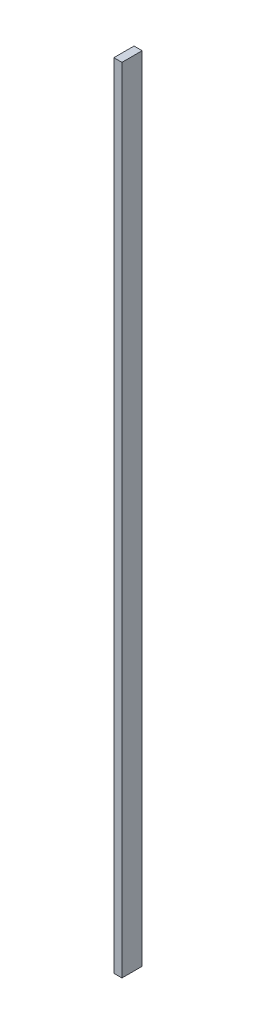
from build123d import *

# Parameters (mm, degrees)
ESQUISSE1_W      = 20
ESQUISSE1_H      = 50
EXTRUSION1_DEPTH = 1960


with BuildPart() as part:
    # Esquisse1 → Extrusion1 (new body)
    with BuildSketch(Plane(origin=(0, 0, 0), x_dir=(1, 0, 0), z_dir=(0, 1, 0))):
        with Locations((10, 25)):
            Rectangle(ESQUISSE1_W, ESQUISSE1_H)
    extrude(amount=EXTRUSION1_DEPTH)


solid = part.part
